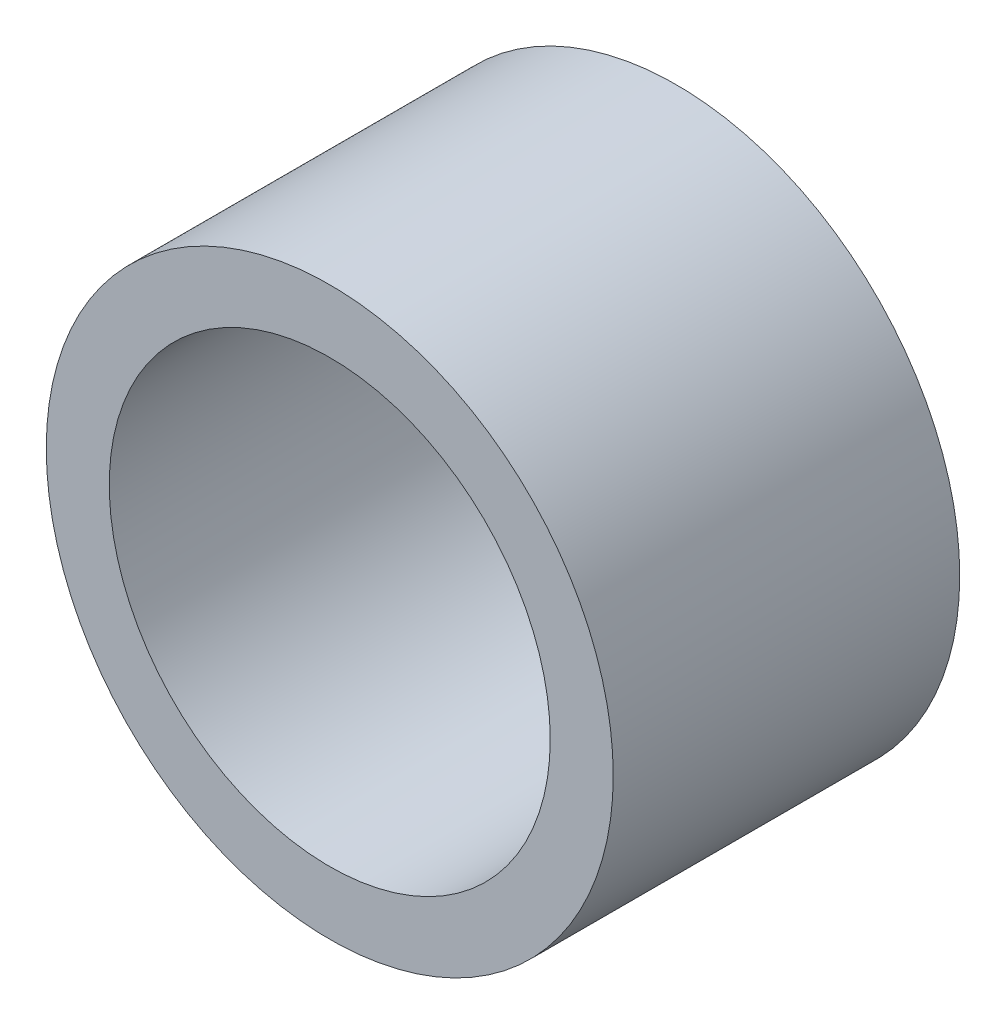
ISO-10303-21;
HEADER;
FILE_DESCRIPTION(('STEP AP214'),'2;1');
FILE_NAME('part.step','',(''),(''),'','','');
FILE_SCHEMA(('AUTOMOTIVE_DESIGN { 1 0 10303 214 1 1 1 1 }'));
ENDSEC;
DATA;
#1=APPLICATION_CONTEXT('core data for automotive mechanical design processes');
#2=APPLICATION_PROTOCOL_DEFINITION('international standard','automotive_design',2000,#1);
#3=PRODUCT_CONTEXT('',#1,'mechanical');
#4=PRODUCT('Part','Part','',(#3));
#5=PRODUCT_RELATED_PRODUCT_CATEGORY('part','',(#4));
#6=PRODUCT_DEFINITION_FORMATION('','',#4);
#7=PRODUCT_DEFINITION_CONTEXT('part definition',#1,'design');
#8=PRODUCT_DEFINITION('design','',#6,#7);
#9=PRODUCT_DEFINITION_SHAPE('','',#8);
#10=(LENGTH_UNIT() NAMED_UNIT(*) SI_UNIT(.MILLI.,.METRE.));
#11=(NAMED_UNIT(*) PLANE_ANGLE_UNIT() SI_UNIT($,.RADIAN.));
#12=(NAMED_UNIT(*) SI_UNIT($,.STERADIAN.) SOLID_ANGLE_UNIT());
#13=UNCERTAINTY_MEASURE_WITH_UNIT(LENGTH_MEASURE(1.E-05),#10,'distance_accuracy_value','');
#14=(GEOMETRIC_REPRESENTATION_CONTEXT(3) GLOBAL_UNCERTAINTY_ASSIGNED_CONTEXT((#13)) GLOBAL_UNIT_ASSIGNED_CONTEXT((#10,
#11,#12)) REPRESENTATION_CONTEXT('',''));
#15=CARTESIAN_POINT('',(0.,0.,0.));
#16=DIRECTION('',(0.,0.,1.));
#17=DIRECTION('',(1.,0.,0.));
#18=AXIS2_PLACEMENT_3D('',#15,#16,#17);
#19=CARTESIAN_POINT('',(0.,0.,22.));
#20=DIRECTION('',(0.,0.,1.));
#21=DIRECTION('',(1.,0.,0.));
#22=AXIS2_PLACEMENT_3D('',#19,#20,#21);
#23=PLANE('',#22);
#24=CARTESIAN_POINT('',(0.,0.,22.));
#25=DIRECTION('',(0.,0.,1.));
#26=DIRECTION('',(1.,0.,0.));
#27=AXIS2_PLACEMENT_3D('',#24,#25,#26);
#28=CIRCLE('',#27,18.);
#29=CARTESIAN_POINT('',(18.,0.,22.));
#30=VERTEX_POINT('',#29);
#31=EDGE_CURVE('E10',#30,#30,#28,.T.);
#32=ORIENTED_EDGE('',*,*,#31,.T.);
#33=EDGE_LOOP('',(#32));
#34=FACE_BOUND('',#33,.T.);
#35=CARTESIAN_POINT('',(0.,0.,22.));
#36=DIRECTION('',(0.,0.,1.));
#37=DIRECTION('',(1.,0.,0.));
#38=AXIS2_PLACEMENT_3D('',#35,#36,#37);
#39=CIRCLE('',#38,14.);
#40=CARTESIAN_POINT('',(14.,0.,22.));
#41=VERTEX_POINT('',#40);
#42=EDGE_CURVE('E41',#41,#41,#39,.T.);
#43=ORIENTED_EDGE('',*,*,#42,.F.);
#44=EDGE_LOOP('',(#43));
#45=FACE_BOUND('',#44,.T.);
#46=ADVANCED_FACE('F30',(#34,#45),#23,.T.);
#47=CARTESIAN_POINT('',(0.,0.,0.));
#48=DIRECTION('',(0.,0.,1.));
#49=DIRECTION('',(1.,0.,0.));
#50=AXIS2_PLACEMENT_3D('',#47,#48,#49);
#51=PLANE('',#50);
#52=CARTESIAN_POINT('',(0.,0.,0.));
#53=DIRECTION('',(0.,0.,1.));
#54=DIRECTION('',(1.,0.,0.));
#55=AXIS2_PLACEMENT_3D('',#52,#53,#54);
#56=CIRCLE('',#55,18.);
#57=CARTESIAN_POINT('',(18.,0.,0.));
#58=VERTEX_POINT('',#57);
#59=EDGE_CURVE('E34',#58,#58,#56,.T.);
#60=ORIENTED_EDGE('',*,*,#59,.F.);
#61=EDGE_LOOP('',(#60));
#62=FACE_BOUND('',#61,.T.);
#63=CARTESIAN_POINT('',(0.,0.,0.));
#64=DIRECTION('',(0.,0.,1.));
#65=DIRECTION('',(1.,0.,0.));
#66=AXIS2_PLACEMENT_3D('',#63,#64,#65);
#67=CIRCLE('',#66,14.);
#68=CARTESIAN_POINT('',(14.,0.,0.));
#69=VERTEX_POINT('',#68);
#70=EDGE_CURVE('E43',#69,#69,#67,.T.);
#71=ORIENTED_EDGE('',*,*,#70,.T.);
#72=EDGE_LOOP('',(#71));
#73=FACE_BOUND('',#72,.T.);
#74=ADVANCED_FACE('F53',(#62,#73),#51,.F.);
#75=CARTESIAN_POINT('',(0.,0.,22.));
#76=DIRECTION('',(0.,0.,-1.));
#77=DIRECTION('',(-1.,0.,0.));
#78=AXIS2_PLACEMENT_3D('',#75,#76,#77);
#79=CYLINDRICAL_SURFACE('',#78,18.);
#80=ORIENTED_EDGE('',*,*,#31,.F.);
#81=EDGE_LOOP('',(#80));
#82=FACE_BOUND('',#81,.T.);
#83=ORIENTED_EDGE('',*,*,#59,.T.);
#84=EDGE_LOOP('',(#83));
#85=FACE_BOUND('',#84,.T.);
#86=ADVANCED_FACE('F32',(#82,#85),#79,.T.);
#87=CARTESIAN_POINT('',(0.,0.,22.));
#88=DIRECTION('',(0.,0.,-1.));
#89=DIRECTION('',(-1.,0.,0.));
#90=AXIS2_PLACEMENT_3D('',#87,#88,#89);
#91=CYLINDRICAL_SURFACE('',#90,14.);
#92=ORIENTED_EDGE('',*,*,#42,.T.);
#93=EDGE_LOOP('',(#92));
#94=FACE_BOUND('',#93,.T.);
#95=ORIENTED_EDGE('',*,*,#70,.F.);
#96=EDGE_LOOP('',(#95));
#97=FACE_BOUND('',#96,.T.);
#98=ADVANCED_FACE('F49',(#94,#97),#91,.F.);
#99=CLOSED_SHELL('',(#46,#74,#86,#98));
#100=MANIFOLD_SOLID_BREP('B2',#99);
#101=ADVANCED_BREP_SHAPE_REPRESENTATION('',(#18,#100),#14);
#102=SHAPE_DEFINITION_REPRESENTATION(#9,#101);
ENDSEC;
END-ISO-10303-21;
